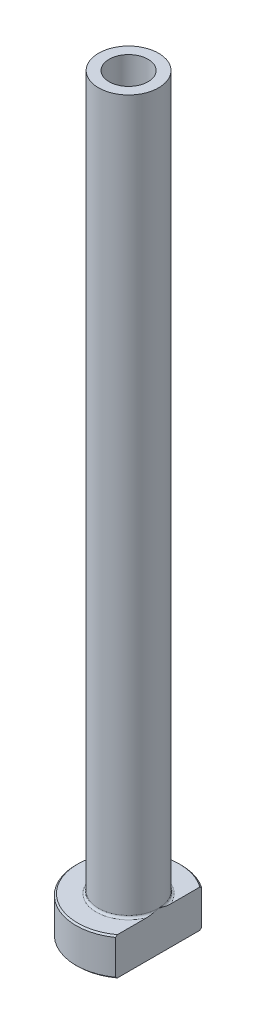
from build123d import *

# Parameters (mm, degrees)
FILLET1_R          = 0.3
CHAMFER1_SIZE      = 0.2
CUT_EXTRUDE1_DEPTH = 101.488805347
CHAMFER2_SIZE      = 0.5


with BuildPart() as part:
    # Sketch1 → Revolve1 (revolve)
    with BuildSketch(Plane.XY, mode=Mode.PRIVATE) as revolve1_sk:
        Polygon((-2.6, 100), (-4, 100), (-4, 5), (-7, 5), (-7, 0), (-2.85, 0), (-2.85, 43), (-2.6, 55), align=None)
    revolve(revolve1_sk.sketch.rotate(Axis((0, 92.187680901, 0), (0, -1, 0)), 270), axis=Axis((0, 92.187680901, 0), (0, -1, 0)))

    # Fillet1
    fillet1_edges = [part.edges().sort_by_distance(p)[0] for p in [
        (0, 5, -4),
    ]]
    fillet(fillet1_edges, radius=FILLET1_R)

    # Chamfer1
    chamfer1_edges = [part.edges().sort_by_distance(p)[0] for p in [
        (0, 0, -7),
        (0, 5, -7),
    ]]
    chamfer(chamfer1_edges, length=CHAMFER1_SIZE)

    # Sketch2 → Cut-Extrude1 (cut, through all)
    with BuildSketch(Plane.XZ):
        with BuildLine():
            Line((4, 5.744562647), (4, -5.744562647))
            ThreePointArc((4, -5.744562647), (7, 0), (4, 5.744562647))
        make_face()
    extrude(amount=-CUT_EXTRUDE1_DEPTH, mode=Mode.SUBTRACT)

    # Chamfer2
    chamfer2_edges = [part.edges().sort_by_distance(p)[0] for p in [
        (0, 0, -2.85),
    ]]
    chamfer(chamfer2_edges, length=CHAMFER2_SIZE)


solid = part.part
